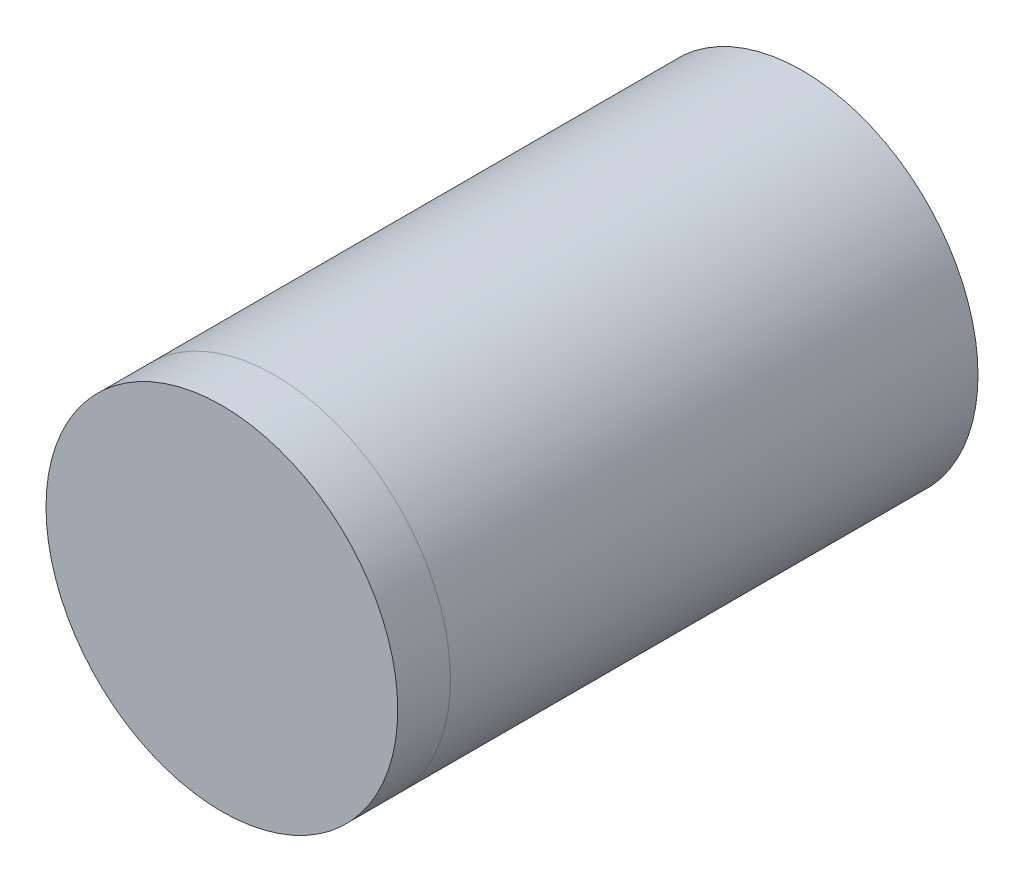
ISO-10303-21;
HEADER;
FILE_DESCRIPTION(('STEP AP214'),'2;1');
FILE_NAME('part.step','',(''),(''),'','','');
FILE_SCHEMA(('AUTOMOTIVE_DESIGN { 1 0 10303 214 1 1 1 1 }'));
ENDSEC;
DATA;
#1=APPLICATION_CONTEXT('core data for automotive mechanical design processes');
#2=APPLICATION_PROTOCOL_DEFINITION('international standard','automotive_design',2000,#1);
#3=PRODUCT_CONTEXT('',#1,'mechanical');
#4=PRODUCT('Part','Part','',(#3));
#5=PRODUCT_RELATED_PRODUCT_CATEGORY('part','',(#4));
#6=PRODUCT_DEFINITION_FORMATION('','',#4);
#7=PRODUCT_DEFINITION_CONTEXT('part definition',#1,'design');
#8=PRODUCT_DEFINITION('design','',#6,#7);
#9=PRODUCT_DEFINITION_SHAPE('','',#8);
#10=(LENGTH_UNIT() NAMED_UNIT(*) SI_UNIT(.MILLI.,.METRE.));
#11=(NAMED_UNIT(*) PLANE_ANGLE_UNIT() SI_UNIT($,.RADIAN.));
#12=(NAMED_UNIT(*) SI_UNIT($,.STERADIAN.) SOLID_ANGLE_UNIT());
#13=UNCERTAINTY_MEASURE_WITH_UNIT(LENGTH_MEASURE(1.E-05),#10,'distance_accuracy_value','');
#14=(GEOMETRIC_REPRESENTATION_CONTEXT(3) GLOBAL_UNCERTAINTY_ASSIGNED_CONTEXT((#13)) GLOBAL_UNIT_ASSIGNED_CONTEXT((#10,
#11,#12)) REPRESENTATION_CONTEXT('',''));
#15=CARTESIAN_POINT('',(0.,0.,0.));
#16=DIRECTION('',(0.,0.,1.));
#17=DIRECTION('',(1.,0.,0.));
#18=AXIS2_PLACEMENT_3D('',#15,#16,#17);
#19=CARTESIAN_POINT('',(0.,0.,16.499));
#20=DIRECTION('',(0.,0.,-1.));
#21=DIRECTION('',(-1.,0.,0.));
#22=AXIS2_PLACEMENT_3D('',#19,#20,#21);
#23=PLANE('',#22);
#24=CARTESIAN_POINT('',(0.,0.,16.499));
#25=DIRECTION('',(0.,0.,-1.));
#26=DIRECTION('',(-1.,0.,0.));
#27=AXIS2_PLACEMENT_3D('',#24,#25,#26);
#28=CIRCLE('',#27,5.0005);
#29=CARTESIAN_POINT('',(-5.0005,0.,16.499));
#30=VERTEX_POINT('',#29);
#31=EDGE_CURVE('E10',#30,#30,#28,.T.);
#32=ORIENTED_EDGE('',*,*,#31,.F.);
#33=EDGE_LOOP('',(#32));
#34=FACE_BOUND('',#33,.T.);
#35=ADVANCED_FACE('F28',(#34),#23,.F.);
#36=CARTESIAN_POINT('',(0.,0.,0.));
#37=DIRECTION('',(0.,0.,-1.));
#38=DIRECTION('',(-1.,0.,0.));
#39=AXIS2_PLACEMENT_3D('',#36,#37,#38);
#40=CYLINDRICAL_SURFACE('',#39,5.0005);
#41=CARTESIAN_POINT('',(0.,0.,14.999));
#42=DIRECTION('',(0.,0.,-1.));
#43=DIRECTION('',(-1.,0.,0.));
#44=AXIS2_PLACEMENT_3D('',#41,#42,#43);
#45=CIRCLE('',#44,5.);
#46=CARTESIAN_POINT('',(-5.,0.,14.999));
#47=VERTEX_POINT('',#46);
#48=EDGE_CURVE('E36',#47,#47,#45,.T.);
#49=ORIENTED_EDGE('',*,*,#48,.F.);
#50=EDGE_LOOP('',(#49));
#51=FACE_BOUND('',#50,.T.);
#52=ORIENTED_EDGE('',*,*,#31,.T.);
#53=EDGE_LOOP('',(#52));
#54=FACE_BOUND('',#53,.T.);
#55=ADVANCED_FACE('F49',(#51,#54),#40,.T.);
#56=CARTESIAN_POINT('',(0.,0.,-0.00100000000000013));
#57=DIRECTION('',(0.,0.,-1.));
#58=DIRECTION('',(-1.,0.,0.));
#59=AXIS2_PLACEMENT_3D('',#56,#57,#58);
#60=CYLINDRICAL_SURFACE('',#59,5.);
#61=CARTESIAN_POINT('',(0.,0.,-0.000999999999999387));
#62=DIRECTION('',(0.,0.,-1.));
#63=DIRECTION('',(-1.,0.,0.));
#64=AXIS2_PLACEMENT_3D('',#61,#62,#63);
#65=CIRCLE('',#64,5.);
#66=CARTESIAN_POINT('',(-5.,0.,-0.000999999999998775));
#67=VERTEX_POINT('',#66);
#68=EDGE_CURVE('E41',#67,#67,#65,.T.);
#69=ORIENTED_EDGE('',*,*,#68,.F.);
#70=EDGE_LOOP('',(#69));
#71=FACE_BOUND('',#70,.T.);
#72=ORIENTED_EDGE('',*,*,#48,.T.);
#73=EDGE_LOOP('',(#72));
#74=FACE_BOUND('',#73,.T.);
#75=ADVANCED_FACE('F51',(#71,#74),#60,.T.);
#76=CARTESIAN_POINT('',(0.,0.,-0.00099999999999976));
#77=DIRECTION('',(0.,0.,1.));
#78=DIRECTION('',(1.,0.,0.));
#79=AXIS2_PLACEMENT_3D('',#76,#77,#78);
#80=PLANE('',#79);
#81=ORIENTED_EDGE('',*,*,#68,.T.);
#82=EDGE_LOOP('',(#81));
#83=FACE_BOUND('',#82,.T.);
#84=ADVANCED_FACE('F56',(#83),#80,.F.);
#85=CLOSED_SHELL('',(#35,#55,#75,#84));
#86=MANIFOLD_SOLID_BREP('B2',#85);
#87=ADVANCED_BREP_SHAPE_REPRESENTATION('',(#18,#86),#14);
#88=SHAPE_DEFINITION_REPRESENTATION(#9,#87);
ENDSEC;
END-ISO-10303-21;
